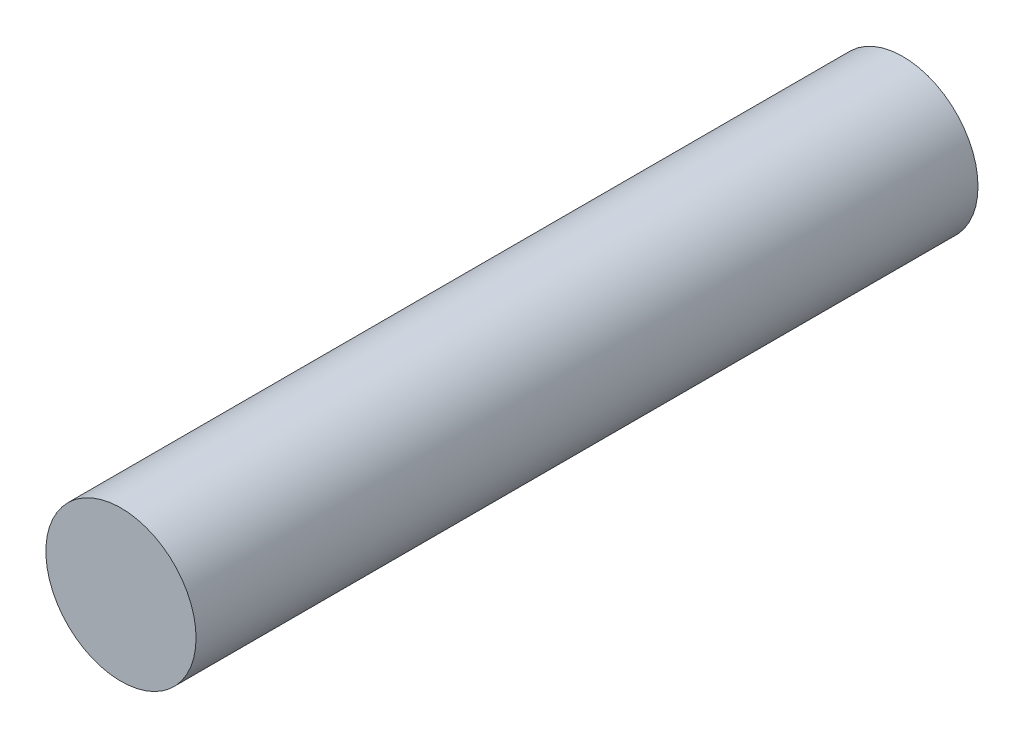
from build123d import *

# Parameters (mm, degrees)
SKETCH2_R           = 4.0005
BOSS_EXTRUDE1_DEPTH = 41.656


with BuildPart() as part:
    # Sketch2 → Boss-Extrude1 (new body)
    with BuildSketch(Plane.XY):
        Circle(SKETCH2_R)
    extrude(amount=BOSS_EXTRUDE1_DEPTH)


solid = part.part
